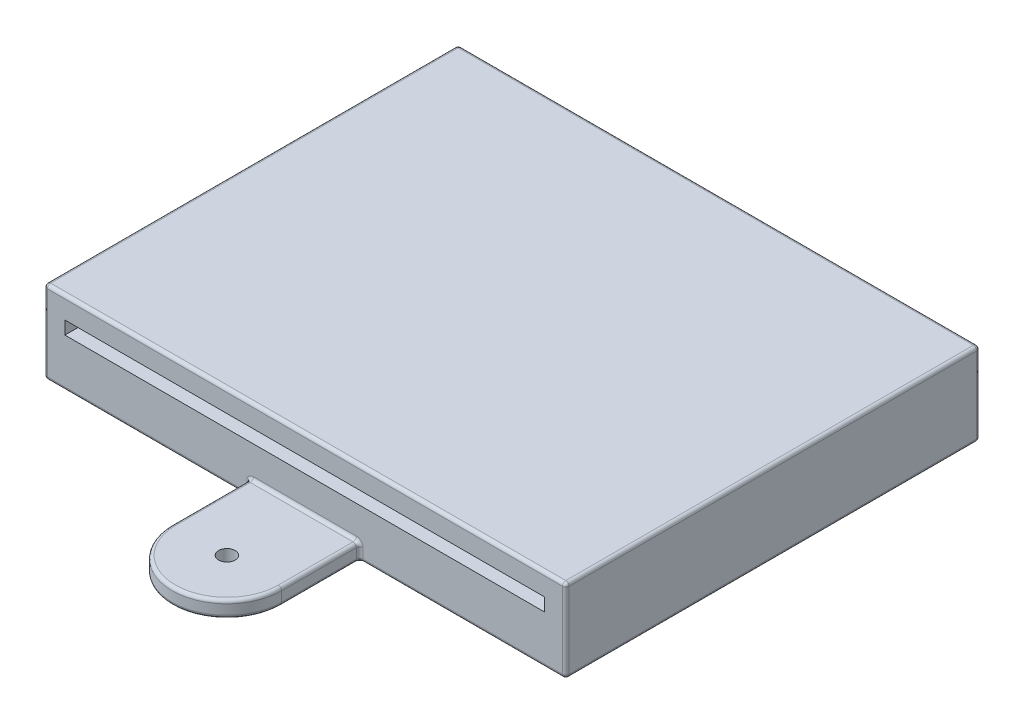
from build123d import *

# Parameters (mm, degrees)
SKETCH1_W          = 800
SKETCH1_H          = 635
EXTRUDE1_DEPTH     = 127
EXTRUDE2_DEPTH     = 25.4
SKETCH3_R          = 12.7
CUT_EXTRUDE1_DEPTH = 670.108693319
SKETCH4_W          = 735
SKETCH4_H          = 20
CUT_EXTRUDE2_DEPTH = 76.2
FILLET1_R          = 5.08


with BuildPart() as part:
    # Sketch1 → Extrude1 (new body)
    with BuildSketch(Plane(origin=(0, 0, 0), x_dir=(1, 0, 0), z_dir=(0, 1, 0))):
        Rectangle(SKETCH1_W, SKETCH1_H)
    extrude(amount=EXTRUDE1_DEPTH)

    # Sketch2 → Extrude2 (add)
    with BuildSketch(Plane.XZ):
        with BuildLine():
            Line((-83.996927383, 317.5), (-83.996927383, 437.134))
            ThreePointArc((-83.996927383, 437.134), (0, 521.130927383), (83.996927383, 437.134))
            Line((83.996927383, 437.134), (83.996927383, 317.5))
            Line((83.996927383, 317.5), (-83.996927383, 317.5))
        make_face()
    extrude(amount=-EXTRUDE2_DEPTH)

    # Sketch3 → Cut-Extrude1 (cut, through all)
    with BuildSketch(Plane.XZ):
        with Locations(Location((0, 437.134, 0), (0, 0, 270))):
            Circle(SKETCH3_R)
    extrude(amount=-CUT_EXTRUDE1_DEPTH, mode=Mode.SUBTRACT)

    # Sketch4 → Cut-Extrude2 (cut)
    with BuildSketch(Plane.XY.offset(317.5)):
        with Locations((-0.5, 84)):
            Rectangle(SKETCH4_W, SKETCH4_H)
    extrude(amount=-CUT_EXTRUDE2_DEPTH, mode=Mode.SUBTRACT)

    # Fillet1
    fillet1_edges = [part.edges().sort_by_distance(p)[0] for p in [
        (400, 127, 0),
        (0, 127, -317.5),
        (241.998463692, 0, 317.5),
        (0, 25.4, 317.5),
        (83.996927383, 12.7, 317.5),
        (-83.996927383, 25.4, 377.317),
        (-83.996927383, 12.7, 317.5),
        (0, 25.4, 521.130927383),
        (83.996927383, 25.4, 377.317),
        (83.996927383, 0, 377.317),
        (0, 0, 521.130927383),
        (-83.996927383, 0, 377.317),
        (0, 0, 449.834),
        (-400, 127, 0),
        (0, 0, -317.5),
        (400, 0, 0),
        (-241.998463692, 0, 317.5),
        (-400, 0, 0),
        (0, 127, 317.5),
        (-400, 63.5, -317.5),
        (400, 63.5, -317.5),
        (400, 63.5, 317.5),
        (-400, 63.5, 317.5),
    ]]
    fillet(fillet1_edges, radius=FILLET1_R)


solid = part.part
